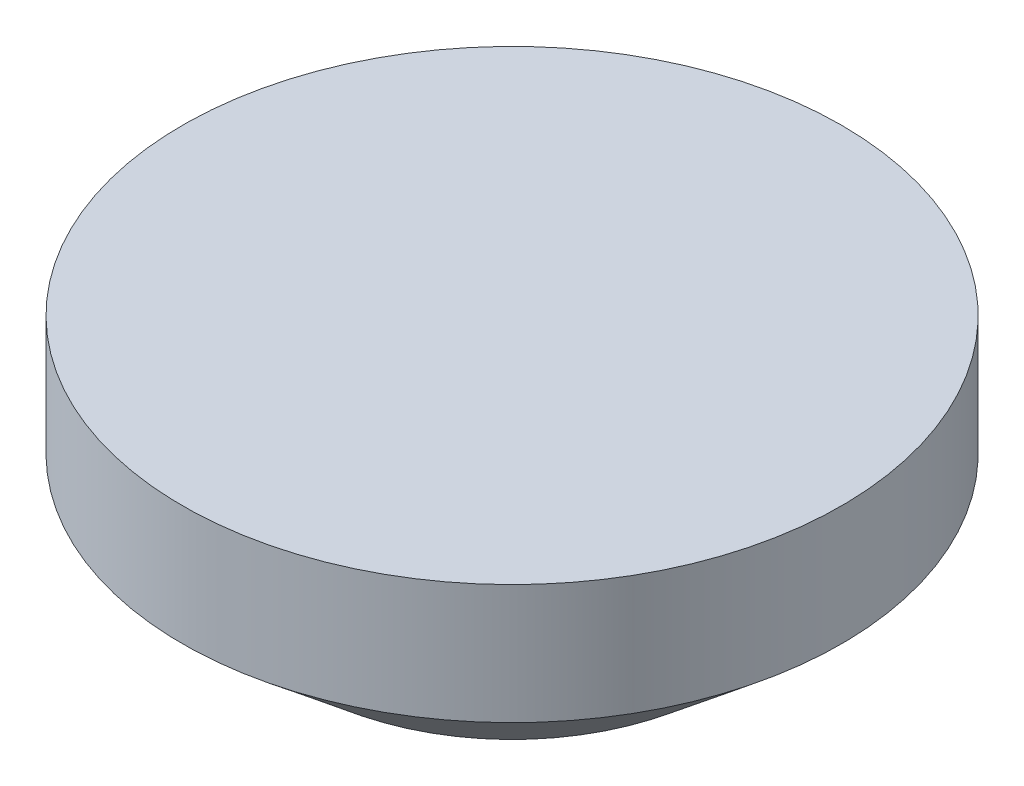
from build123d import *


with BuildPart() as part:
    # Sketch 1 → Revolve 1 (revolve)
    with BuildSketch(Plane.XY, mode=Mode.PRIVATE) as revolve_1_sk:
        Polygon((0, 375), (565, 375), (565, 170), (360, 0), (0, 0), align=None)
    revolve(revolve_1_sk.sketch.rotate(Axis((0, 0, 0), (0, 1, 0)), 90), axis=Axis((0, 0, 0), (0, 1, 0)))


solid = part.part
